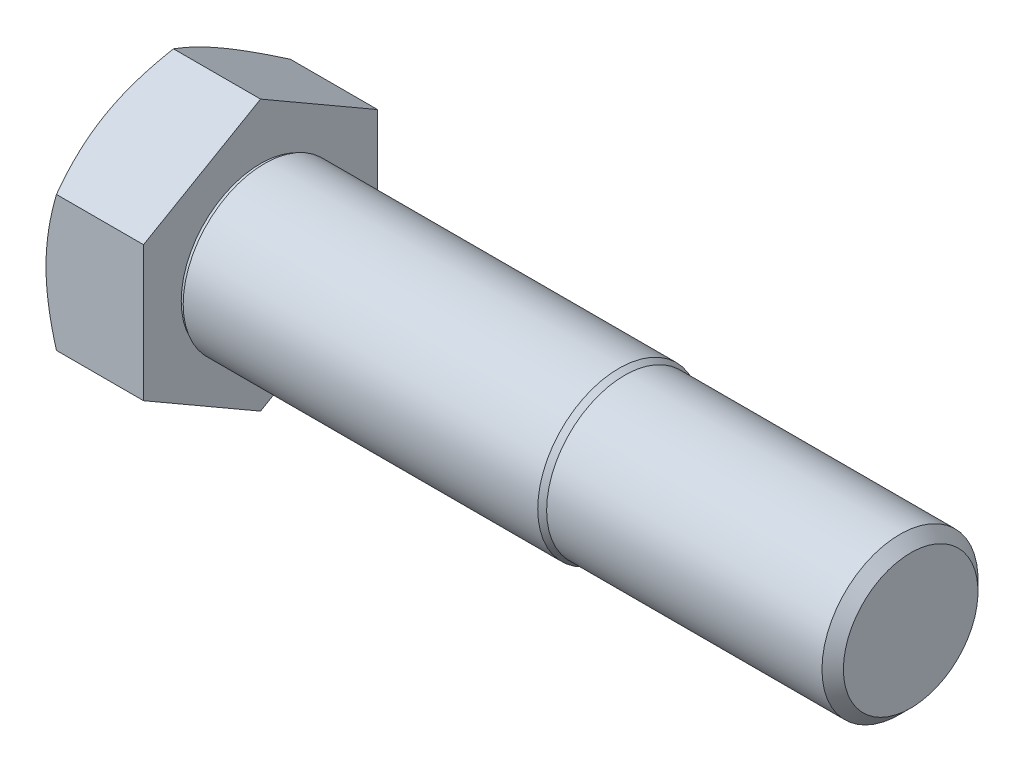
ISO-10303-21;
HEADER;
FILE_DESCRIPTION(('STEP AP214'),'2;1');
FILE_NAME('part.step','',(''),(''),'','','');
FILE_SCHEMA(('AUTOMOTIVE_DESIGN { 1 0 10303 214 1 1 1 1 }'));
ENDSEC;
DATA;
#1=APPLICATION_CONTEXT('core data for automotive mechanical design processes');
#2=APPLICATION_PROTOCOL_DEFINITION('international standard','automotive_design',2000,#1);
#3=PRODUCT_CONTEXT('',#1,'mechanical');
#4=PRODUCT('Part','Part','',(#3));
#5=PRODUCT_RELATED_PRODUCT_CATEGORY('part','',(#4));
#6=PRODUCT_DEFINITION_FORMATION('','',#4);
#7=PRODUCT_DEFINITION_CONTEXT('part definition',#1,'design');
#8=PRODUCT_DEFINITION('design','',#6,#7);
#9=PRODUCT_DEFINITION_SHAPE('','',#8);
#10=(LENGTH_UNIT() NAMED_UNIT(*) SI_UNIT(.MILLI.,.METRE.));
#11=(NAMED_UNIT(*) PLANE_ANGLE_UNIT() SI_UNIT($,.RADIAN.));
#12=(NAMED_UNIT(*) SI_UNIT($,.STERADIAN.) SOLID_ANGLE_UNIT());
#13=UNCERTAINTY_MEASURE_WITH_UNIT(LENGTH_MEASURE(1.E-05),#10,'distance_accuracy_value','');
#14=(GEOMETRIC_REPRESENTATION_CONTEXT(3) GLOBAL_UNCERTAINTY_ASSIGNED_CONTEXT((#13)) GLOBAL_UNIT_ASSIGNED_CONTEXT((#10,
#11,#12)) REPRESENTATION_CONTEXT('',''));
#15=CARTESIAN_POINT('',(0.,0.,0.));
#16=DIRECTION('',(0.,0.,1.));
#17=DIRECTION('',(1.,0.,0.));
#18=AXIS2_PLACEMENT_3D('',#15,#16,#17);
#19=CARTESIAN_POINT('',(15.,31.1769145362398,18.));
#20=DIRECTION('',(1.,0.,0.));
#21=DIRECTION('',(0.,0.,-1.));
#22=AXIS2_PLACEMENT_3D('',#19,#20,#21);
#23=PLANE('',#22);
#24=DIRECTION('',(0.,0.5,0.866025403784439));
#25=VECTOR('',#24,1.);
#26=CARTESIAN_POINT('',(15.,10.3923048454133,-18.));
#27=LINE('',#26,#25);
#28=CARTESIAN_POINT('',(15.,10.3923048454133,-18.));
#29=VERTEX_POINT('',#28);
#30=CARTESIAN_POINT('',(15.,20.7846096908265,0.));
#31=VERTEX_POINT('',#30);
#32=EDGE_CURVE('E156',#29,#31,#27,.T.);
#33=ORIENTED_EDGE('',*,*,#32,.T.);
#34=DIRECTION('',(0.,-0.5,0.866025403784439));
#35=VECTOR('',#34,1.);
#36=CARTESIAN_POINT('',(15.,20.7846096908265,0.));
#37=LINE('',#36,#35);
#38=CARTESIAN_POINT('',(15.,10.3923048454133,18.));
#39=VERTEX_POINT('',#38);
#40=EDGE_CURVE('E151',#31,#39,#37,.T.);
#41=ORIENTED_EDGE('',*,*,#40,.T.);
#42=DIRECTION('',(0.,-1.,0.));
#43=VECTOR('',#42,1.);
#44=CARTESIAN_POINT('',(15.,10.3923048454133,18.));
#45=LINE('',#44,#43);
#46=CARTESIAN_POINT('',(15.,-10.3923048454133,18.));
#47=VERTEX_POINT('',#46);
#48=EDGE_CURVE('E134',#39,#47,#45,.T.);
#49=ORIENTED_EDGE('',*,*,#48,.T.);
#50=DIRECTION('',(0.,-0.5,-0.866025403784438));
#51=VECTOR('',#50,1.);
#52=CARTESIAN_POINT('',(15.,-10.3923048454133,18.));
#53=LINE('',#52,#51);
#54=CARTESIAN_POINT('',(15.,-20.7846096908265,0.));
#55=VERTEX_POINT('',#54);
#56=EDGE_CURVE('E154',#47,#55,#53,.T.);
#57=ORIENTED_EDGE('',*,*,#56,.T.);
#58=DIRECTION('',(0.,0.5,-0.866025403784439));
#59=VECTOR('',#58,1.);
#60=CARTESIAN_POINT('',(15.,-20.7846096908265,0.));
#61=LINE('',#60,#59);
#62=CARTESIAN_POINT('',(15.,-10.3923048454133,-18.));
#63=VERTEX_POINT('',#62);
#64=EDGE_CURVE('E146',#55,#63,#61,.T.);
#65=ORIENTED_EDGE('',*,*,#64,.T.);
#66=DIRECTION('',(0.,1.,0.));
#67=VECTOR('',#66,1.);
#68=CARTESIAN_POINT('',(15.,-10.3923048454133,-18.));
#69=LINE('',#68,#67);
#70=EDGE_CURVE('E147',#63,#29,#69,.T.);
#71=ORIENTED_EDGE('',*,*,#70,.T.);
#72=EDGE_LOOP('',(#33,#41,#49,#57,#65,#71));
#73=FACE_BOUND('',#72,.T.);
#74=CARTESIAN_POINT('',(15.,0.,0.));
#75=DIRECTION('',(-1.,0.,0.));
#76=DIRECTION('',(0.,0.,1.));
#77=AXIS2_PLACEMENT_3D('',#74,#75,#76);
#78=CIRCLE('',#77,12.2);
#79=CARTESIAN_POINT('',(15.,0.,12.2));
#80=VERTEX_POINT('',#79);
#81=EDGE_CURVE('E249',#80,#80,#78,.T.);
#82=ORIENTED_EDGE('',*,*,#81,.T.);
#83=EDGE_LOOP('',(#82));
#84=FACE_BOUND('',#83,.T.);
#85=ADVANCED_FACE('F39',(#73,#84),#23,.T.);
#86=CARTESIAN_POINT('',(15.,10.3923048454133,-18.));
#87=DIRECTION('',(0.,-0.866025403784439,0.5));
#88=DIRECTION('',(0.,-0.5,-0.866025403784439));
#89=AXIS2_PLACEMENT_3D('',#86,#87,#88);
#90=PLANE('',#89);
#91=CARTESIAN_POINT('',(1.60776182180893,20.7847251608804,0.000199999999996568));
#92=CARTESIAN_POINT('',(1.47589336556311,20.5563065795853,-0.395432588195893));
#93=CARTESIAN_POINT('',(1.35000889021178,20.3269970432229,-0.792608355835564));
#94=CARTESIAN_POINT('',(1.11187123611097,19.8665391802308,-1.59014476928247));
#95=CARTESIAN_POINT('',(0.999622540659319,19.6353902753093,-1.99050641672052));
#96=CARTESIAN_POINT('',(0.790265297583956,19.1708069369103,-2.79518836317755));
#97=CARTESIAN_POINT('',(0.693192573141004,18.9373684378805,-3.19951570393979));
#98=CARTESIAN_POINT('',(0.516271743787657,18.4688693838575,-4.01097986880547));
#99=CARTESIAN_POINT('',(0.436422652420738,18.2338089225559,-4.41811653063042));
#100=CARTESIAN_POINT('',(0.297345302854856,17.7680889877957,-5.22476711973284));
#101=CARTESIAN_POINT('',(0.237656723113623,17.537464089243,-5.62422116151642));
#102=CARTESIAN_POINT('',(0.137572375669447,17.0751575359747,-6.42495960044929));
#103=CARTESIAN_POINT('',(0.0971769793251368,16.8434758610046,-6.82624403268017));
#104=CARTESIAN_POINT('',(0.0366989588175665,16.3797233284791,-7.62948698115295));
#105=CARTESIAN_POINT('',(0.0165921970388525,16.1476532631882,-8.03144412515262));
#106=CARTESIAN_POINT('',(-0.00287614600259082,15.6832989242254,-8.83572943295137));
#107=CARTESIAN_POINT('',(-0.00223836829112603,15.4510146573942,-9.23805758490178));
#108=CARTESIAN_POINT('',(0.0183335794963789,15.0167538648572,-9.9902193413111));
#109=CARTESIAN_POINT('',(0.0357591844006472,14.8147463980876,-10.3401065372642));
#110=CARTESIAN_POINT('',(0.0859690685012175,14.4112133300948,-11.0390463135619));
#111=CARTESIAN_POINT('',(0.118753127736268,14.209687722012,-11.3880989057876));
#112=CARTESIAN_POINT('',(0.199111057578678,13.8071947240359,-12.0852372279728));
#113=CARTESIAN_POINT('',(0.246698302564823,13.6062280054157,-12.4333217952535));
#114=CARTESIAN_POINT('',(0.355822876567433,13.2052512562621,-13.1278338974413));
#115=CARTESIAN_POINT('',(0.417360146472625,13.0052412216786,-13.4742614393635));
#116=CARTESIAN_POINT('',(0.624462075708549,12.3980849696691,-14.525886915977));
#117=CARTESIAN_POINT('',(0.79067746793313,11.99269701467,-15.228039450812));
#118=CARTESIAN_POINT('',(1.16791817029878,11.1879658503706,-16.6218747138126));
#119=CARTESIAN_POINT('',(1.37885488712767,10.78861233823,-17.3135752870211));
#120=CARTESIAN_POINT('',(1.60776182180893,10.3921893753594,-18.0002));
#121=B_SPLINE_CURVE_WITH_KNOTS('',3,(#91,#92,#93,#94,#95,#96,#97,#98,#99,#100,#101,#102,#103,
#104,#105,#106,#107,#108,#109,#110,#111,#112,#113,#114,#115,#116,#117,#118,#119,#120),
.UNSPECIFIED.,.F.,.F.,(4,2,2,2,2,2,2,2,2,2,2,2,2,2,4),(0.,1.42650335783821,2.85347447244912,
4.28376471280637,5.71397301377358,7.10888071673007,8.5038152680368,9.89708828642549,
11.2903182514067,12.5031974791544,13.7160593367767,14.9300201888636,16.1439758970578,
18.6253607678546,21.1018751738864),.UNSPECIFIED.);
#122=CARTESIAN_POINT('',(1.60769515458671,20.7846096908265,0.));
#123=VERTEX_POINT('',#122);
#124=CARTESIAN_POINT('',(0.,15.5884572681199,-9.));
#125=VERTEX_POINT('',#124);
#126=EDGE_CURVE('E57',#123,#125,#121,.T.);
#127=ORIENTED_EDGE('',*,*,#126,.F.);
#128=DIRECTION('',(-1.,0.,0.));
#129=VECTOR('',#128,1.);
#130=CARTESIAN_POINT('',(15.,20.7846096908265,0.));
#131=LINE('',#130,#129);
#132=EDGE_CURVE('E132',#31,#123,#131,.T.);
#133=ORIENTED_EDGE('',*,*,#132,.F.);
#134=ORIENTED_EDGE('',*,*,#32,.F.);
#135=DIRECTION('',(-1.,0.,0.));
#136=VECTOR('',#135,1.);
#137=CARTESIAN_POINT('',(15.,10.3923048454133,-18.));
#138=LINE('',#137,#136);
#139=CARTESIAN_POINT('',(1.60769515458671,10.3923048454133,-18.));
#140=VERTEX_POINT('',#139);
#141=EDGE_CURVE('E143',#29,#140,#138,.T.);
#142=ORIENTED_EDGE('',*,*,#141,.T.);
#143=EDGE_CURVE('E203',#125,#140,#121,.T.);
#144=ORIENTED_EDGE('',*,*,#143,.F.);
#145=EDGE_LOOP('',(#127,#133,#134,#142,#144));
#146=FACE_BOUND('',#145,.T.);
#147=ADVANCED_FACE('F41',(#146),#90,.F.);
#148=CARTESIAN_POINT('',(15.,20.7846096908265,0.));
#149=DIRECTION('',(0.,-0.866025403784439,-0.5));
#150=DIRECTION('',(0.,0.5,-0.866025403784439));
#151=AXIS2_PLACEMENT_3D('',#148,#149,#150);
#152=PLANE('',#151);
#153=CARTESIAN_POINT('',(1.60776182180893,10.3921893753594,18.0002));
#154=CARTESIAN_POINT('',(1.47589336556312,10.6206079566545,17.6045674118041));
#155=CARTESIAN_POINT('',(1.35000889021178,10.8499174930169,17.2073916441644));
#156=CARTESIAN_POINT('',(1.11187123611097,11.310375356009,16.4098552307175));
#157=CARTESIAN_POINT('',(0.999622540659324,11.5415242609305,16.0094935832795));
#158=CARTESIAN_POINT('',(0.790265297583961,12.0061075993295,15.2048116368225));
#159=CARTESIAN_POINT('',(0.693192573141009,12.2395460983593,14.8004842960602));
#160=CARTESIAN_POINT('',(0.51627174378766,12.7080451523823,13.9890201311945));
#161=CARTESIAN_POINT('',(0.436422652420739,12.9431056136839,13.5818834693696));
#162=CARTESIAN_POINT('',(0.297345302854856,13.4088255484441,12.7752328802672));
#163=CARTESIAN_POINT('',(0.237656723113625,13.6394504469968,12.3757788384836));
#164=CARTESIAN_POINT('',(0.137572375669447,14.1017570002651,11.5750403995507));
#165=CARTESIAN_POINT('',(0.0971769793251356,14.3334386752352,11.1737559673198));
#166=CARTESIAN_POINT('',(0.0366989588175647,14.7971912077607,10.3705130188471));
#167=CARTESIAN_POINT('',(0.0165921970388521,15.0292612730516,9.96855587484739));
#168=CARTESIAN_POINT('',(-0.00287614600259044,15.4936156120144,9.16427056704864));
#169=CARTESIAN_POINT('',(-0.00223836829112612,15.7258998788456,8.76194241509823));
#170=CARTESIAN_POINT('',(0.018333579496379,16.1601606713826,8.0097806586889));
#171=CARTESIAN_POINT('',(0.0357591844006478,16.3621681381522,7.65989346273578));
#172=CARTESIAN_POINT('',(0.0859690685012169,16.765701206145,6.9609536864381));
#173=CARTESIAN_POINT('',(0.118753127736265,16.9672268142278,6.61190109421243));
#174=CARTESIAN_POINT('',(0.199111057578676,17.3697198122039,5.91476277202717));
#175=CARTESIAN_POINT('',(0.246698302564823,17.5706865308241,5.56667820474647));
#176=CARTESIAN_POINT('',(0.355822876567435,17.9716632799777,4.87216610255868));
#177=CARTESIAN_POINT('',(0.417360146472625,18.1716733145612,4.52573856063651));
#178=CARTESIAN_POINT('',(0.624462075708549,18.7788295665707,3.47411308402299));
#179=CARTESIAN_POINT('',(0.790677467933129,19.1842175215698,2.77196054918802));
#180=CARTESIAN_POINT('',(1.16791817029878,19.9889486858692,1.37812528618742));
#181=CARTESIAN_POINT('',(1.37885488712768,20.3883021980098,0.68642471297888));
#182=CARTESIAN_POINT('',(1.60776182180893,20.7847251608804,-0.000200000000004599));
#183=B_SPLINE_CURVE_WITH_KNOTS('',3,(#153,#154,#155,#156,#157,#158,#159,#160,#161,#162,#163,
#164,#165,#166,#167,#168,#169,#170,#171,#172,#173,#174,#175,#176,#177,#178,#179,#180,#181,#182),
.UNSPECIFIED.,.F.,.F.,(4,2,2,2,2,2,2,2,2,2,2,2,2,2,4),(0.,1.42650335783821,2.85347447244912,
4.28376471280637,5.71397301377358,7.10888071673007,8.5038152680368,9.89708828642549,
11.2903182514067,12.5031974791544,13.7160593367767,14.9300201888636,16.1439758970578,
18.6253607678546,21.1018751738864),.UNSPECIFIED.);
#184=CARTESIAN_POINT('',(1.60769515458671,10.3923048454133,18.));
#185=VERTEX_POINT('',#184);
#186=CARTESIAN_POINT('',(0.,15.5884572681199,9.));
#187=VERTEX_POINT('',#186);
#188=EDGE_CURVE('E62',#185,#187,#183,.T.);
#189=ORIENTED_EDGE('',*,*,#188,.F.);
#190=DIRECTION('',(-1.,0.,0.));
#191=VECTOR('',#190,1.);
#192=CARTESIAN_POINT('',(15.,10.3923048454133,18.));
#193=LINE('',#192,#191);
#194=EDGE_CURVE('E123',#39,#185,#193,.T.);
#195=ORIENTED_EDGE('',*,*,#194,.F.);
#196=ORIENTED_EDGE('',*,*,#40,.F.);
#197=ORIENTED_EDGE('',*,*,#132,.T.);
#198=EDGE_CURVE('E127',#187,#123,#183,.T.);
#199=ORIENTED_EDGE('',*,*,#198,.F.);
#200=EDGE_LOOP('',(#189,#195,#196,#197,#199));
#201=FACE_BOUND('',#200,.T.);
#202=ADVANCED_FACE('F121',(#201),#152,.F.);
#203=CARTESIAN_POINT('',(15.,10.3923048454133,18.));
#204=DIRECTION('',(0.,0.,-1.));
#205=DIRECTION('',(0.,1.,0.));
#206=AXIS2_PLACEMENT_3D('',#203,#204,#205);
#207=PLANE('',#206);
#208=CARTESIAN_POINT('',(8.61348069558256,-27.5619239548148,18.));
#209=CARTESIAN_POINT('',(8.42247770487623,-27.1667877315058,18.));
#210=CARTESIAN_POINT('',(8.23246323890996,-26.7711739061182,18.));
#211=CARTESIAN_POINT('',(7.85463825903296,-25.978890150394,18.));
#212=CARTESIAN_POINT('',(7.66682776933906,-25.5822202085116,18.));
#213=CARTESIAN_POINT('',(7.10698821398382,-24.3903587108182,18.));
#214=CARTESIAN_POINT('',(6.73861331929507,-23.5934439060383,18.));
#215=CARTESIAN_POINT('',(6.01187832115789,-21.9895471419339,18.));
#216=CARTESIAN_POINT('',(5.65358759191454,-21.1825336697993,18.));
#217=CARTESIAN_POINT('',(4.95238944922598,-19.5618746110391,18.));
#218=CARTESIAN_POINT('',(4.60948123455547,-18.7482293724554,18.));
#219=CARTESIAN_POINT('',(3.93907746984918,-17.1029123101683,18.));
#220=CARTESIAN_POINT('',(3.61182282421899,-16.2711418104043,18.));
#221=CARTESIAN_POINT('',(2.98294292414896,-14.597784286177,18.));
#222=CARTESIAN_POINT('',(2.68132051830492,-13.7561961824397,18.));
#223=CARTESIAN_POINT('',(2.11181367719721,-12.0636207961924,18.));
#224=CARTESIAN_POINT('',(1.84385751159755,-11.2126578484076,18.));
#225=CARTESIAN_POINT('',(1.35037221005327,-9.49855213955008,18.));
#226=CARTESIAN_POINT('',(1.12482967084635,-8.63541331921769,18.));
#227=CARTESIAN_POINT('',(0.826582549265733,-7.33140916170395,18.));
#228=CARTESIAN_POINT('',(0.733829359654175,-6.89509921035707,18.));
#229=CARTESIAN_POINT('',(0.563143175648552,-6.01957542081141,18.));
#230=CARTESIAN_POINT('',(0.485209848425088,-5.58036164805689,18.));
#231=CARTESIAN_POINT('',(0.345545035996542,-4.6993249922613,18.));
#232=CARTESIAN_POINT('',(0.283814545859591,-4.25750195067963,18.));
#233=CARTESIAN_POINT('',(0.177795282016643,-3.37175302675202,18.));
#234=CARTESIAN_POINT('',(0.133506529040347,-2.92782714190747,18.));
#235=CARTESIAN_POINT('',(0.0635630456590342,-2.04133804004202,18.));
#236=CARTESIAN_POINT('',(0.0377917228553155,-1.598784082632,18.));
#237=CARTESIAN_POINT('',(0.00501858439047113,-0.712983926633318,18.));
#238=CARTESIAN_POINT('',(-0.00198351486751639,-0.269737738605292,18.));
#239=CARTESIAN_POINT('',(0.00294785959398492,0.616528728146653,18.));
#240=CARTESIAN_POINT('',(0.0148760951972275,1.05954903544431,18.));
#241=CARTESIAN_POINT('',(0.0573715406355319,1.9446967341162,18.));
#242=CARTESIAN_POINT('',(0.0879395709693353,2.38682408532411,18.));
#243=CARTESIAN_POINT('',(0.183949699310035,3.45808110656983,18.));
#244=CARTESIAN_POINT('',(0.258712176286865,4.08639173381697,18.));
#245=CARTESIAN_POINT('',(0.441718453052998,5.33809089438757,18.));
#246=CARTESIAN_POINT('',(0.549967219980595,5.96147868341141,18.));
#247=CARTESIAN_POINT('',(0.919513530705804,7.82534534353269,18.));
#248=CARTESIAN_POINT('',(1.22536507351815,9.05709271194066,18.));
#249=CARTESIAN_POINT('',(1.75275444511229,10.8995809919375,18.));
#250=CARTESIAN_POINT('',(1.94256699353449,11.5199484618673,18.));
#251=CARTESIAN_POINT('',(2.34111719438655,12.7546900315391,18.));
#252=CARTESIAN_POINT('',(2.54985655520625,13.3690635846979,18.));
#253=CARTESIAN_POINT('',(2.98181266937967,14.5887549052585,18.));
#254=CARTESIAN_POINT('',(3.20494114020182,15.1941042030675,18.));
#255=CARTESIAN_POINT('',(3.5492943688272,16.0983156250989,18.));
#256=CARTESIAN_POINT('',(3.66566915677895,16.3990354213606,18.));
#257=CARTESIAN_POINT('',(3.90137756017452,16.9993068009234,18.));
#258=CARTESIAN_POINT('',(4.02071111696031,17.2988584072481,18.));
#259=CARTESIAN_POINT('',(4.141390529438,17.5978664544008,18.));
#260=B_SPLINE_CURVE_WITH_KNOTS('',3,(#208,#209,#210,#211,#212,#213,#214,#215,#216,#217,#218,
#219,#220,#221,#222,#223,#224,#225,#226,#227,#228,#229,#230,#231,#232,#233,#234,#235,#236,#237,
#238,#239,#240,#241,#242,#243,#244,#245,#246,#247,#248,#249,#250,#251,#252,#253,#254,#255,#256,
#257,#258,#259),.UNSPECIFIED.,.F.,.F.,(4,2,2,2,2,2,2,2,2,2,2,2,2,2,2,2,2,2,2,2,2,2,2,2,2,4),(0.,
1.3166344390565,2.6332833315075,5.26700924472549,7.91580691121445,10.5644664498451,
13.2456434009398,15.9271179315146,18.6027786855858,21.2775924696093,22.6155612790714,
23.9535000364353,25.2915209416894,26.6295434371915,27.9590656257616,29.2885677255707,
30.6177020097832,31.9468948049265,33.8440459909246,35.7414787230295,39.5436531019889,
41.4897689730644,43.4360606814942,45.3713764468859,46.3387197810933,47.3060439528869),.UNSPECIFIED.);
#261=CARTESIAN_POINT('',(1.60769515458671,-10.3923048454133,18.));
#262=VERTEX_POINT('',#261);
#263=CARTESIAN_POINT('',(0.,0.,18.));
#264=VERTEX_POINT('',#263);
#265=EDGE_CURVE('E117',#262,#264,#260,.T.);
#266=ORIENTED_EDGE('',*,*,#265,.F.);
#267=DIRECTION('',(-1.,0.,0.));
#268=VECTOR('',#267,1.);
#269=CARTESIAN_POINT('',(15.,-10.3923048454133,18.));
#270=LINE('',#269,#268);
#271=EDGE_CURVE('E135',#47,#262,#270,.T.);
#272=ORIENTED_EDGE('',*,*,#271,.F.);
#273=ORIENTED_EDGE('',*,*,#48,.F.);
#274=ORIENTED_EDGE('',*,*,#194,.T.);
#275=EDGE_CURVE('E109',#264,#185,#260,.T.);
#276=ORIENTED_EDGE('',*,*,#275,.F.);
#277=EDGE_LOOP('',(#266,#272,#273,#274,#276));
#278=FACE_BOUND('',#277,.T.);
#279=ADVANCED_FACE('F126',(#278),#207,.F.);
#280=CARTESIAN_POINT('',(15.,-10.3923048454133,18.));
#281=DIRECTION('',(0.,0.866025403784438,-0.5));
#282=DIRECTION('',(0.,0.5,0.866025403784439));
#283=AXIS2_PLACEMENT_3D('',#280,#281,#282);
#284=PLANE('',#283);
#285=CARTESIAN_POINT('',(1.60776182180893,-20.7847251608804,-0.00019999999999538));
#286=CARTESIAN_POINT('',(1.47589336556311,-20.5563065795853,0.395432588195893));
#287=CARTESIAN_POINT('',(1.35000889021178,-20.3269970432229,0.792608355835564));
#288=CARTESIAN_POINT('',(1.11187123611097,-19.8665391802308,1.59014476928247));
#289=CARTESIAN_POINT('',(0.999622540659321,-19.6353902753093,1.99050641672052));
#290=CARTESIAN_POINT('',(0.79026529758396,-19.1708069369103,2.79518836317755));
#291=CARTESIAN_POINT('',(0.693192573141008,-18.9373684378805,3.19951570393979));
#292=CARTESIAN_POINT('',(0.516271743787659,-18.4688693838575,4.01097986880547));
#293=CARTESIAN_POINT('',(0.436422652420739,-18.2338089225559,4.41811653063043));
#294=CARTESIAN_POINT('',(0.297345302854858,-17.7680889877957,5.22476711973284));
#295=CARTESIAN_POINT('',(0.237656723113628,-17.537464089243,5.62422116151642));
#296=CARTESIAN_POINT('',(0.13757237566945,-17.0751575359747,6.42495960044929));
#297=CARTESIAN_POINT('',(0.0971769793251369,-16.8434758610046,6.82624403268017));
#298=CARTESIAN_POINT('',(0.0366989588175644,-16.3797233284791,7.62948698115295));
#299=CARTESIAN_POINT('',(0.0165921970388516,-16.1476532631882,8.03144412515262));
#300=CARTESIAN_POINT('',(-0.00287614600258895,-15.6832989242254,8.83572943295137));
#301=CARTESIAN_POINT('',(-0.00223836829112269,-15.4510146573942,9.23805758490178));
#302=CARTESIAN_POINT('',(0.0183335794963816,-15.0167538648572,9.99021934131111));
#303=CARTESIAN_POINT('',(0.0357591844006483,-14.8147463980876,10.3401065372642));
#304=CARTESIAN_POINT('',(0.085969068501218,-14.4112133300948,11.0390463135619));
#305=CARTESIAN_POINT('',(0.118753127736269,-14.209687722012,11.3880989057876));
#306=CARTESIAN_POINT('',(0.19911105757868,-13.8071947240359,12.0852372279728));
#307=CARTESIAN_POINT('',(0.246698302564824,-13.6062280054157,12.4333217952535));
#308=CARTESIAN_POINT('',(0.355822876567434,-13.2052512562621,13.1278338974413));
#309=CARTESIAN_POINT('',(0.417360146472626,-13.0052412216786,13.4742614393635));
#310=CARTESIAN_POINT('',(0.624462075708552,-12.3980849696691,14.525886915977));
#311=CARTESIAN_POINT('',(0.790677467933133,-11.99269701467,15.228039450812));
#312=CARTESIAN_POINT('',(1.16791817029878,-11.1879658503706,16.6218747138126));
#313=CARTESIAN_POINT('',(1.37885488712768,-10.78861233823,17.3135752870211));
#314=CARTESIAN_POINT('',(1.60776182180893,-10.3921893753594,18.0002));
#315=B_SPLINE_CURVE_WITH_KNOTS('',3,(#285,#286,#287,#288,#289,#290,#291,#292,#293,#294,#295,
#296,#297,#298,#299,#300,#301,#302,#303,#304,#305,#306,#307,#308,#309,#310,#311,#312,#313,#314),
.UNSPECIFIED.,.F.,.F.,(4,2,2,2,2,2,2,2,2,2,2,2,2,2,4),(0.,1.42650335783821,2.85347447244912,
4.28376471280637,5.71397301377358,7.10888071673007,8.5038152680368,9.89708828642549,
11.2903182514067,12.5031974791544,13.7160593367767,14.9300201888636,16.1439758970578,
18.6253607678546,21.1018751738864),.UNSPECIFIED.);
#316=CARTESIAN_POINT('',(1.60769515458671,-20.7846096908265,0.));
#317=VERTEX_POINT('',#316);
#318=CARTESIAN_POINT('',(0.,-15.5884572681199,9.));
#319=VERTEX_POINT('',#318);
#320=EDGE_CURVE('E209',#317,#319,#315,.T.);
#321=ORIENTED_EDGE('',*,*,#320,.F.);
#322=DIRECTION('',(-1.,0.,0.));
#323=VECTOR('',#322,1.);
#324=CARTESIAN_POINT('',(15.,-20.7846096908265,0.));
#325=LINE('',#324,#323);
#326=EDGE_CURVE('E136',#55,#317,#325,.T.);
#327=ORIENTED_EDGE('',*,*,#326,.F.);
#328=ORIENTED_EDGE('',*,*,#56,.F.);
#329=ORIENTED_EDGE('',*,*,#271,.T.);
#330=EDGE_CURVE('E118',#319,#262,#315,.T.);
#331=ORIENTED_EDGE('',*,*,#330,.F.);
#332=EDGE_LOOP('',(#321,#327,#328,#329,#331));
#333=FACE_BOUND('',#332,.T.);
#334=ADVANCED_FACE('F211',(#333),#284,.F.);
#335=CARTESIAN_POINT('',(15.,-20.7846096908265,0.));
#336=DIRECTION('',(0.,0.866025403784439,0.5));
#337=DIRECTION('',(0.,-0.5,0.866025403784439));
#338=AXIS2_PLACEMENT_3D('',#335,#336,#337);
#339=PLANE('',#338);
#340=CARTESIAN_POINT('',(1.60776182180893,-10.3921893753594,-18.0002));
#341=CARTESIAN_POINT('',(1.47589336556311,-10.6206079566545,-17.6045674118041));
#342=CARTESIAN_POINT('',(1.35000889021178,-10.8499174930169,-17.2073916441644));
#343=CARTESIAN_POINT('',(1.11187123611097,-11.310375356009,-16.4098552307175));
#344=CARTESIAN_POINT('',(0.999622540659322,-11.5415242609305,-16.0094935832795));
#345=CARTESIAN_POINT('',(0.790265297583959,-12.0061075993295,-15.2048116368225));
#346=CARTESIAN_POINT('',(0.693192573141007,-12.2395460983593,-14.8004842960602));
#347=CARTESIAN_POINT('',(0.516271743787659,-12.7080451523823,-13.9890201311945));
#348=CARTESIAN_POINT('',(0.436422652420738,-12.9431056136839,-13.5818834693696));
#349=CARTESIAN_POINT('',(0.297345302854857,-13.4088255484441,-12.7752328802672));
#350=CARTESIAN_POINT('',(0.237656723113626,-13.6394504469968,-12.3757788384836));
#351=CARTESIAN_POINT('',(0.137572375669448,-14.1017570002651,-11.5750403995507));
#352=CARTESIAN_POINT('',(0.0971769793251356,-14.3334386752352,-11.1737559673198));
#353=CARTESIAN_POINT('',(0.0366989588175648,-14.7971912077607,-10.370513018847));
#354=CARTESIAN_POINT('',(0.0165921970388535,-15.0292612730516,-9.96855587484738));
#355=CARTESIAN_POINT('',(-0.00287614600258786,-15.4936156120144,-9.16427056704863));
#356=CARTESIAN_POINT('',(-0.00223836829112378,-15.7258998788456,-8.76194241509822));
#357=CARTESIAN_POINT('',(0.0183335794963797,-16.1601606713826,-8.00978065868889));
#358=CARTESIAN_POINT('',(0.0357591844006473,-16.3621681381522,-7.65989346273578));
#359=CARTESIAN_POINT('',(0.085969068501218,-16.765701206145,-6.96095368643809));
#360=CARTESIAN_POINT('',(0.118753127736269,-16.9672268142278,-6.61190109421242));
#361=CARTESIAN_POINT('',(0.19911105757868,-17.3697198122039,-5.91476277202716));
#362=CARTESIAN_POINT('',(0.246698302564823,-17.5706865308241,-5.56667820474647));
#363=CARTESIAN_POINT('',(0.355822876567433,-17.9716632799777,-4.87216610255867));
#364=CARTESIAN_POINT('',(0.417360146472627,-18.1716733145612,-4.52573856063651));
#365=CARTESIAN_POINT('',(0.624462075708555,-18.7788295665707,-3.47411308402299));
#366=CARTESIAN_POINT('',(0.790677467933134,-19.1842175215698,-2.77196054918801));
#367=CARTESIAN_POINT('',(1.16791817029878,-19.9889486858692,-1.37812528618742));
#368=CARTESIAN_POINT('',(1.37885488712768,-20.3883021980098,-0.686424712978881));
#369=CARTESIAN_POINT('',(1.60776182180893,-20.7847251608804,0.000200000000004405));
#370=B_SPLINE_CURVE_WITH_KNOTS('',3,(#340,#341,#342,#343,#344,#345,#346,#347,#348,#349,#350,
#351,#352,#353,#354,#355,#356,#357,#358,#359,#360,#361,#362,#363,#364,#365,#366,#367,#368,#369),
.UNSPECIFIED.,.F.,.F.,(4,2,2,2,2,2,2,2,2,2,2,2,2,2,4),(0.,1.42650335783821,2.85347447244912,
4.28376471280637,5.71397301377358,7.10888071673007,8.5038152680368,9.89708828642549,
11.2903182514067,12.5031974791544,13.7160593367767,14.9300201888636,16.1439758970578,
18.6253607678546,21.1018751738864),.UNSPECIFIED.);
#371=CARTESIAN_POINT('',(1.60769515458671,-10.3923048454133,-18.));
#372=VERTEX_POINT('',#371);
#373=CARTESIAN_POINT('',(0.,-15.5884572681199,-9.));
#374=VERTEX_POINT('',#373);
#375=EDGE_CURVE('E198',#372,#374,#370,.T.);
#376=ORIENTED_EDGE('',*,*,#375,.F.);
#377=DIRECTION('',(-1.,0.,0.));
#378=VECTOR('',#377,1.);
#379=CARTESIAN_POINT('',(15.,-10.3923048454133,-18.));
#380=LINE('',#379,#378);
#381=EDGE_CURVE('E145',#63,#372,#380,.T.);
#382=ORIENTED_EDGE('',*,*,#381,.F.);
#383=ORIENTED_EDGE('',*,*,#64,.F.);
#384=ORIENTED_EDGE('',*,*,#326,.T.);
#385=EDGE_CURVE('E215',#374,#317,#370,.T.);
#386=ORIENTED_EDGE('',*,*,#385,.F.);
#387=EDGE_LOOP('',(#376,#382,#383,#384,#386));
#388=FACE_BOUND('',#387,.T.);
#389=ADVANCED_FACE('F217',(#388),#339,.F.);
#390=CARTESIAN_POINT('',(15.,-10.3923048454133,-18.));
#391=DIRECTION('',(0.,0.,1.));
#392=DIRECTION('',(0.,-1.,0.));
#393=AXIS2_PLACEMENT_3D('',#390,#391,#392);
#394=PLANE('',#393);
#395=CARTESIAN_POINT('',(8.61348069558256,-27.5619239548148,-18.));
#396=CARTESIAN_POINT('',(8.42247770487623,-27.1667877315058,-18.));
#397=CARTESIAN_POINT('',(8.23246323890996,-26.7711739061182,-18.));
#398=CARTESIAN_POINT('',(7.85463825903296,-25.978890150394,-18.));
#399=CARTESIAN_POINT('',(7.66682776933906,-25.5822202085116,-18.));
#400=CARTESIAN_POINT('',(7.10698821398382,-24.3903587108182,-18.));
#401=CARTESIAN_POINT('',(6.73861331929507,-23.5934439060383,-18.));
#402=CARTESIAN_POINT('',(6.01187832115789,-21.9895471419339,-18.));
#403=CARTESIAN_POINT('',(5.65358759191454,-21.1825336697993,-18.));
#404=CARTESIAN_POINT('',(4.95238944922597,-19.5618746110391,-18.));
#405=CARTESIAN_POINT('',(4.60948123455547,-18.7482293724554,-18.));
#406=CARTESIAN_POINT('',(3.93907746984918,-17.1029123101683,-18.));
#407=CARTESIAN_POINT('',(3.61182282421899,-16.2711418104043,-18.));
#408=CARTESIAN_POINT('',(2.98294292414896,-14.597784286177,-18.));
#409=CARTESIAN_POINT('',(2.68132051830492,-13.7561961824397,-18.));
#410=CARTESIAN_POINT('',(2.11181367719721,-12.0636207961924,-18.));
#411=CARTESIAN_POINT('',(1.84385751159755,-11.2126578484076,-18.));
#412=CARTESIAN_POINT('',(1.35037221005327,-9.49855213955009,-18.));
#413=CARTESIAN_POINT('',(1.12482967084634,-8.6354133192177,-18.));
#414=CARTESIAN_POINT('',(0.826582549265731,-7.33140916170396,-18.));
#415=CARTESIAN_POINT('',(0.733829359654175,-6.89509921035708,-18.));
#416=CARTESIAN_POINT('',(0.563143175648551,-6.01957542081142,-18.));
#417=CARTESIAN_POINT('',(0.485209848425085,-5.5803616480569,-18.));
#418=CARTESIAN_POINT('',(0.345545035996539,-4.69932499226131,-18.));
#419=CARTESIAN_POINT('',(0.28381454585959,-4.25750195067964,-18.));
#420=CARTESIAN_POINT('',(0.177795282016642,-3.37175302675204,-18.));
#421=CARTESIAN_POINT('',(0.133506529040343,-2.92782714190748,-18.));
#422=CARTESIAN_POINT('',(0.0635630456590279,-2.04133804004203,-18.));
#423=CARTESIAN_POINT('',(0.0377917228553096,-1.59878408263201,-18.));
#424=CARTESIAN_POINT('',(0.00501858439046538,-0.712983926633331,-18.));
#425=CARTESIAN_POINT('',(-0.00198351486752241,-0.269737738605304,-18.));
#426=CARTESIAN_POINT('',(0.00294785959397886,0.616528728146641,-18.));
#427=CARTESIAN_POINT('',(0.0148760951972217,1.05954903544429,-18.));
#428=CARTESIAN_POINT('',(0.0573715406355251,1.94469673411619,-18.));
#429=CARTESIAN_POINT('',(0.0879395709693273,2.3868240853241,-18.));
#430=CARTESIAN_POINT('',(0.183949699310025,3.45808110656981,-18.));
#431=CARTESIAN_POINT('',(0.258712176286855,4.08639173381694,-18.));
#432=CARTESIAN_POINT('',(0.441718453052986,5.33809089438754,-18.));
#433=CARTESIAN_POINT('',(0.549967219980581,5.96147868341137,-18.));
#434=CARTESIAN_POINT('',(0.919513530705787,7.82534534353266,-18.));
#435=CARTESIAN_POINT('',(1.22536507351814,9.05709271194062,-18.));
#436=CARTESIAN_POINT('',(1.75275444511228,10.8995809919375,-18.));
#437=CARTESIAN_POINT('',(1.94256699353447,11.5199484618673,-18.));
#438=CARTESIAN_POINT('',(2.34111719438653,12.7546900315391,-18.));
#439=CARTESIAN_POINT('',(2.54985655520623,13.3690635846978,-18.));
#440=CARTESIAN_POINT('',(2.98181266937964,14.5887549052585,-18.));
#441=CARTESIAN_POINT('',(3.2049411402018,15.1941042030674,-18.));
#442=CARTESIAN_POINT('',(3.54929436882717,16.0983156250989,-18.));
#443=CARTESIAN_POINT('',(3.66566915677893,16.3990354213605,-18.));
#444=CARTESIAN_POINT('',(3.9013775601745,16.9993068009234,-18.));
#445=CARTESIAN_POINT('',(4.02071111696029,17.298858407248,-18.));
#446=CARTESIAN_POINT('',(4.14139052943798,17.5978664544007,-18.));
#447=B_SPLINE_CURVE_WITH_KNOTS('',3,(#395,#396,#397,#398,#399,#400,#401,#402,#403,#404,#405,
#406,#407,#408,#409,#410,#411,#412,#413,#414,#415,#416,#417,#418,#419,#420,#421,#422,#423,#424,
#425,#426,#427,#428,#429,#430,#431,#432,#433,#434,#435,#436,#437,#438,#439,#440,#441,#442,#443,
#444,#445,#446),.UNSPECIFIED.,.F.,.F.,(4,2,2,2,2,2,2,2,2,2,2,2,2,2,2,2,2,2,2,2,2,2,2,2,2,4),(0.,
1.3166344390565,2.6332833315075,5.26700924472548,7.91580691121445,10.5644664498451,
13.2456434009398,15.9271179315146,18.6027786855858,21.2775924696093,22.6155612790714,
23.9535000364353,25.2915209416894,26.6295434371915,27.9590656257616,29.2885677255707,
30.6177020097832,31.9468948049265,33.8440459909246,35.7414787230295,39.5436531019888,
41.4897689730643,43.4360606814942,45.3713764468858,46.3387197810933,47.3060439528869),.UNSPECIFIED.);
#448=CARTESIAN_POINT('',(0.,0.,-18.));
#449=VERTEX_POINT('',#448);
#450=EDGE_CURVE('E275',#140,#449,#447,.F.);
#451=ORIENTED_EDGE('',*,*,#450,.F.);
#452=ORIENTED_EDGE('',*,*,#141,.F.);
#453=ORIENTED_EDGE('',*,*,#70,.F.);
#454=ORIENTED_EDGE('',*,*,#381,.T.);
#455=EDGE_CURVE('E187',#449,#372,#447,.F.);
#456=ORIENTED_EDGE('',*,*,#455,.F.);
#457=EDGE_LOOP('',(#451,#452,#453,#454,#456));
#458=FACE_BOUND('',#457,.T.);
#459=ADVANCED_FACE('F221',(#458),#394,.F.);
#460=CARTESIAN_POINT('',(0.,0.,0.));
#461=DIRECTION('',(1.,0.,0.));
#462=DIRECTION('',(0.,0.,-1.));
#463=AXIS2_PLACEMENT_3D('',#460,#461,#462);
#464=CONICAL_SURFACE('',#463,18.,1.0471975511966);
#465=ORIENTED_EDGE('',*,*,#375,.T.);
#466=CARTESIAN_POINT('',(0.,0.,0.));
#467=DIRECTION('',(1.,0.,0.));
#468=DIRECTION('',(0.,0.,-1.));
#469=AXIS2_PLACEMENT_3D('',#466,#467,#468);
#470=CIRCLE('',#469,18.);
#471=EDGE_CURVE('E42',#374,#449,#470,.T.);
#472=ORIENTED_EDGE('',*,*,#471,.T.);
#473=ORIENTED_EDGE('',*,*,#455,.T.);
#474=EDGE_LOOP('',(#465,#472,#473));
#475=FACE_BOUND('',#474,.T.);
#476=ADVANCED_FACE('F177',(#475),#464,.T.);
#477=ORIENTED_EDGE('',*,*,#320,.T.);
#478=EDGE_CURVE('E289',#319,#374,#470,.T.);
#479=ORIENTED_EDGE('',*,*,#478,.T.);
#480=ORIENTED_EDGE('',*,*,#385,.T.);
#481=EDGE_LOOP('',(#477,#479,#480));
#482=FACE_BOUND('',#481,.T.);
#483=ADVANCED_FACE('F180',(#482),#464,.T.);
#484=ORIENTED_EDGE('',*,*,#265,.T.);
#485=EDGE_CURVE('E295',#264,#319,#470,.T.);
#486=ORIENTED_EDGE('',*,*,#485,.T.);
#487=ORIENTED_EDGE('',*,*,#330,.T.);
#488=EDGE_LOOP('',(#484,#486,#487));
#489=FACE_BOUND('',#488,.T.);
#490=ADVANCED_FACE('F175',(#489),#464,.T.);
#491=ORIENTED_EDGE('',*,*,#275,.T.);
#492=ORIENTED_EDGE('',*,*,#188,.T.);
#493=CARTESIAN_POINT('',(0.,0.,0.));
#494=DIRECTION('',(-1.,0.,0.));
#495=DIRECTION('',(0.,0.,1.));
#496=AXIS2_PLACEMENT_3D('',#493,#494,#495);
#497=CIRCLE('',#496,18.);
#498=EDGE_CURVE('E113',#264,#187,#497,.T.);
#499=ORIENTED_EDGE('',*,*,#498,.F.);
#500=EDGE_LOOP('',(#491,#492,#499));
#501=FACE_BOUND('',#500,.T.);
#502=ADVANCED_FACE('F111',(#501),#464,.T.);
#503=ORIENTED_EDGE('',*,*,#198,.T.);
#504=ORIENTED_EDGE('',*,*,#126,.T.);
#505=EDGE_CURVE('E47',#125,#187,#470,.T.);
#506=ORIENTED_EDGE('',*,*,#505,.T.);
#507=EDGE_LOOP('',(#503,#504,#506));
#508=FACE_BOUND('',#507,.T.);
#509=ADVANCED_FACE('F238',(#508),#464,.T.);
#510=ORIENTED_EDGE('',*,*,#143,.T.);
#511=ORIENTED_EDGE('',*,*,#450,.T.);
#512=EDGE_CURVE('E11',#449,#125,#470,.T.);
#513=ORIENTED_EDGE('',*,*,#512,.T.);
#514=EDGE_LOOP('',(#510,#511,#513));
#515=FACE_BOUND('',#514,.T.);
#516=ADVANCED_FACE('F230',(#515),#464,.T.);
#517=CARTESIAN_POINT('',(0.,31.1769145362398,18.));
#518=DIRECTION('',(1.,0.,0.));
#519=DIRECTION('',(0.,0.,-1.));
#520=AXIS2_PLACEMENT_3D('',#517,#518,#519);
#521=PLANE('',#520);
#522=ORIENTED_EDGE('',*,*,#512,.F.);
#523=ORIENTED_EDGE('',*,*,#471,.F.);
#524=ORIENTED_EDGE('',*,*,#478,.F.);
#525=ORIENTED_EDGE('',*,*,#485,.F.);
#526=ORIENTED_EDGE('',*,*,#498,.T.);
#527=ORIENTED_EDGE('',*,*,#505,.F.);
#528=EDGE_LOOP('',(#522,#523,#524,#525,#526,#527));
#529=FACE_BOUND('',#528,.T.);
#530=ADVANCED_FACE('F227',(#529),#521,.F.);
#531=CARTESIAN_POINT('',(115.,10.352,0.));
#532=DIRECTION('',(-1.,0.,0.));
#533=DIRECTION('',(0.,0.,1.));
#534=AXIS2_PLACEMENT_3D('',#531,#532,#533);
#535=PLANE('',#534);
#536=CARTESIAN_POINT('',(115.,0.,0.));
#537=DIRECTION('',(-1.,0.,0.));
#538=DIRECTION('',(0.,0.,1.));
#539=AXIS2_PLACEMENT_3D('',#536,#537,#538);
#540=CIRCLE('',#539,10.352);
#541=CARTESIAN_POINT('',(115.,0.,10.352));
#542=VERTEX_POINT('',#541);
#543=EDGE_CURVE('E268',#542,#542,#540,.T.);
#544=ORIENTED_EDGE('',*,*,#543,.F.);
#545=EDGE_LOOP('',(#544));
#546=FACE_BOUND('',#545,.T.);
#547=ADVANCED_FACE('F179',(#546),#535,.F.);
#548=CARTESIAN_POINT('',(115.,0.,0.));
#549=DIRECTION('',(-1.,0.,0.));
#550=DIRECTION('',(0.,0.,1.));
#551=AXIS2_PLACEMENT_3D('',#548,#549,#550);
#552=CONICAL_SURFACE('',#551,10.352,0.785398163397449);
#553=CARTESIAN_POINT('',(113.352,0.,0.));
#554=DIRECTION('',(-1.,0.,0.));
#555=DIRECTION('',(0.,0.,1.));
#556=AXIS2_PLACEMENT_3D('',#553,#554,#555);
#557=CIRCLE('',#556,12.);
#558=CARTESIAN_POINT('',(113.352,0.,12.));
#559=VERTEX_POINT('',#558);
#560=EDGE_CURVE('E269',#559,#559,#557,.T.);
#561=ORIENTED_EDGE('',*,*,#560,.F.);
#562=EDGE_LOOP('',(#561));
#563=FACE_BOUND('',#562,.T.);
#564=ORIENTED_EDGE('',*,*,#543,.T.);
#565=EDGE_LOOP('',(#564));
#566=FACE_BOUND('',#565,.T.);
#567=ADVANCED_FACE('F236',(#563,#566),#552,.T.);
#568=CARTESIAN_POINT('',(0.,0.,0.));
#569=DIRECTION('',(-1.,0.,0.));
#570=DIRECTION('',(0.,0.,1.));
#571=AXIS2_PLACEMENT_3D('',#568,#569,#570);
#572=CYLINDRICAL_SURFACE('',#571,12.);
#573=CARTESIAN_POINT('',(71.,0.,0.));
#574=DIRECTION('',(-1.,0.,0.));
#575=DIRECTION('',(0.,0.,1.));
#576=AXIS2_PLACEMENT_3D('',#573,#574,#575);
#577=CIRCLE('',#576,12.);
#578=CARTESIAN_POINT('',(71.,0.,12.));
#579=VERTEX_POINT('',#578);
#580=EDGE_CURVE('E262',#579,#579,#577,.T.);
#581=ORIENTED_EDGE('',*,*,#580,.F.);
#582=EDGE_LOOP('',(#581));
#583=FACE_BOUND('',#582,.T.);
#584=ORIENTED_EDGE('',*,*,#560,.T.);
#585=EDGE_LOOP('',(#584));
#586=FACE_BOUND('',#585,.T.);
#587=ADVANCED_FACE('F394',(#583,#586),#572,.T.);
#588=CARTESIAN_POINT('',(71.,0.,0.));
#589=DIRECTION('',(-1.,0.,0.));
#590=DIRECTION('',(0.,0.,1.));
#591=AXIS2_PLACEMENT_3D('',#588,#589,#590);
#592=CONICAL_SURFACE('',#591,12.,0.523598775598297);
#593=CARTESIAN_POINT('',(70.1339745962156,0.,0.));
#594=DIRECTION('',(-1.,0.,0.));
#595=DIRECTION('',(0.,0.,1.));
#596=AXIS2_PLACEMENT_3D('',#593,#594,#595);
#597=CIRCLE('',#596,12.5);
#598=CARTESIAN_POINT('',(70.1339745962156,0.,12.5));
#599=VERTEX_POINT('',#598);
#600=EDGE_CURVE('E256',#599,#599,#597,.T.);
#601=ORIENTED_EDGE('',*,*,#600,.F.);
#602=EDGE_LOOP('',(#601));
#603=FACE_BOUND('',#602,.T.);
#604=ORIENTED_EDGE('',*,*,#580,.T.);
#605=EDGE_LOOP('',(#604));
#606=FACE_BOUND('',#605,.T.);
#607=ADVANCED_FACE('F397',(#603,#606),#592,.T.);
#608=CARTESIAN_POINT('',(0.,0.,0.));
#609=DIRECTION('',(-1.,0.,0.));
#610=DIRECTION('',(0.,0.,1.));
#611=AXIS2_PLACEMENT_3D('',#608,#609,#610);
#612=CYLINDRICAL_SURFACE('',#611,12.5);
#613=CARTESIAN_POINT('',(15.6,0.,0.));
#614=DIRECTION('',(-1.,0.,0.));
#615=DIRECTION('',(0.,0.,1.));
#616=AXIS2_PLACEMENT_3D('',#613,#614,#615);
#617=CIRCLE('',#616,12.5);
#618=CARTESIAN_POINT('',(15.6,0.,12.5));
#619=VERTEX_POINT('',#618);
#620=EDGE_CURVE('E253',#619,#619,#617,.T.);
#621=ORIENTED_EDGE('',*,*,#620,.F.);
#622=EDGE_LOOP('',(#621));
#623=FACE_BOUND('',#622,.T.);
#624=ORIENTED_EDGE('',*,*,#600,.T.);
#625=EDGE_LOOP('',(#624));
#626=FACE_BOUND('',#625,.T.);
#627=ADVANCED_FACE('F410',(#623,#626),#612,.T.);
#628=CARTESIAN_POINT('',(15.6,12.2,0.));
#629=DIRECTION('',(1.,0.,0.));
#630=DIRECTION('',(0.,0.,-1.));
#631=AXIS2_PLACEMENT_3D('',#628,#629,#630);
#632=PLANE('',#631);
#633=CARTESIAN_POINT('',(15.6,0.,0.));
#634=DIRECTION('',(-1.,0.,0.));
#635=DIRECTION('',(0.,0.,1.));
#636=AXIS2_PLACEMENT_3D('',#633,#634,#635);
#637=CIRCLE('',#636,12.2);
#638=CARTESIAN_POINT('',(15.6,0.,12.2));
#639=VERTEX_POINT('',#638);
#640=EDGE_CURVE('E255',#639,#639,#637,.T.);
#641=ORIENTED_EDGE('',*,*,#640,.F.);
#642=EDGE_LOOP('',(#641));
#643=FACE_BOUND('',#642,.T.);
#644=ORIENTED_EDGE('',*,*,#620,.T.);
#645=EDGE_LOOP('',(#644));
#646=FACE_BOUND('',#645,.T.);
#647=ADVANCED_FACE('F420',(#643,#646),#632,.F.);
#648=CARTESIAN_POINT('',(0.,0.,0.));
#649=DIRECTION('',(-1.,0.,0.));
#650=DIRECTION('',(0.,0.,1.));
#651=AXIS2_PLACEMENT_3D('',#648,#649,#650);
#652=CYLINDRICAL_SURFACE('',#651,12.2);
#653=ORIENTED_EDGE('',*,*,#81,.F.);
#654=EDGE_LOOP('',(#653));
#655=FACE_BOUND('',#654,.T.);
#656=ORIENTED_EDGE('',*,*,#640,.T.);
#657=EDGE_LOOP('',(#656));
#658=FACE_BOUND('',#657,.T.);
#659=ADVANCED_FACE('F430',(#655,#658),#652,.T.);
#660=CLOSED_SHELL('',(#85,#147,#202,#279,#334,#389,#459,#476,#483,#490,#502,#509,#516,#530,#547,
#567,#587,#607,#627,#647,#659));
#661=MANIFOLD_SOLID_BREP('B2',#660);
#662=ADVANCED_BREP_SHAPE_REPRESENTATION('',(#18,#661),#14);
#663=SHAPE_DEFINITION_REPRESENTATION(#9,#662);
ENDSEC;
END-ISO-10303-21;
